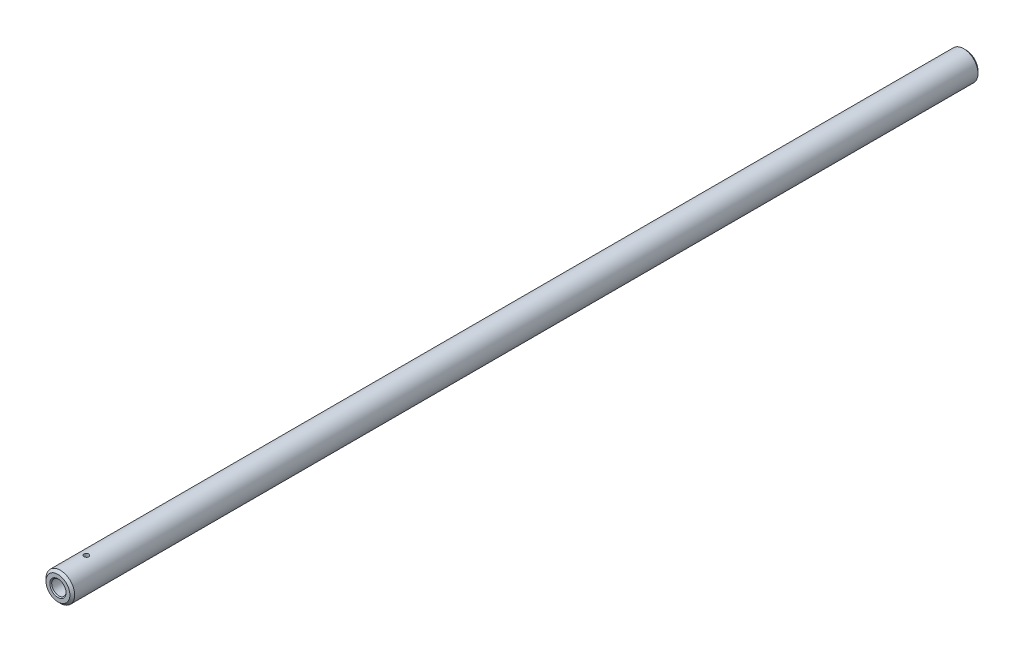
ISO-10303-21;
HEADER;
FILE_DESCRIPTION(('STEP AP214'),'2;1');
FILE_NAME('part.step','',(''),(''),'','','');
FILE_SCHEMA(('AUTOMOTIVE_DESIGN { 1 0 10303 214 1 1 1 1 }'));
ENDSEC;
DATA;
#1=APPLICATION_CONTEXT('core data for automotive mechanical design processes');
#2=APPLICATION_PROTOCOL_DEFINITION('international standard','automotive_design',2000,#1);
#3=PRODUCT_CONTEXT('',#1,'mechanical');
#4=PRODUCT('Part','Part','',(#3));
#5=PRODUCT_RELATED_PRODUCT_CATEGORY('part','',(#4));
#6=PRODUCT_DEFINITION_FORMATION('','',#4);
#7=PRODUCT_DEFINITION_CONTEXT('part definition',#1,'design');
#8=PRODUCT_DEFINITION('design','',#6,#7);
#9=PRODUCT_DEFINITION_SHAPE('','',#8);
#10=(LENGTH_UNIT() NAMED_UNIT(*) SI_UNIT(.MILLI.,.METRE.));
#11=(NAMED_UNIT(*) PLANE_ANGLE_UNIT() SI_UNIT($,.RADIAN.));
#12=(NAMED_UNIT(*) SI_UNIT($,.STERADIAN.) SOLID_ANGLE_UNIT());
#13=UNCERTAINTY_MEASURE_WITH_UNIT(LENGTH_MEASURE(1.E-05),#10,'distance_accuracy_value','');
#14=(GEOMETRIC_REPRESENTATION_CONTEXT(3) GLOBAL_UNCERTAINTY_ASSIGNED_CONTEXT((#13)) GLOBAL_UNIT_ASSIGNED_CONTEXT((#10,
#11,#12)) REPRESENTATION_CONTEXT('',''));
#15=CARTESIAN_POINT('',(0.,0.,0.));
#16=DIRECTION('',(0.,0.,1.));
#17=DIRECTION('',(1.,0.,0.));
#18=AXIS2_PLACEMENT_3D('',#15,#16,#17);
#19=CARTESIAN_POINT('',(0.,0.,190.));
#20=DIRECTION('',(0.,0.,-1.));
#21=DIRECTION('',(-1.,0.,0.));
#22=AXIS2_PLACEMENT_3D('',#19,#20,#21);
#23=CYLINDRICAL_SURFACE('',#22,3.);
#24=CARTESIAN_POINT('',(0.,-3.,184.576605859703));
#25=CARTESIAN_POINT('',(0.0278781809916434,-2.99999952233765,184.576604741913));
#26=CARTESIAN_POINT('',(0.0557715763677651,-2.99960735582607,184.574266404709));
#27=CARTESIAN_POINT('',(0.110776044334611,-2.99808068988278,184.56497872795));
#28=CARTESIAN_POINT('',(0.137886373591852,-2.99694550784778,184.558025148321));
#29=CARTESIAN_POINT('',(0.190520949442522,-2.9940601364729,184.539722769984));
#30=CARTESIAN_POINT('',(0.216046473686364,-2.99231045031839,184.528377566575));
#31=CARTESIAN_POINT('',(0.264828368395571,-2.98838845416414,184.501623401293));
#32=CARTESIAN_POINT('',(0.288084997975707,-2.98621619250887,184.486214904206));
#33=CARTESIAN_POINT('',(0.331894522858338,-2.98166663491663,184.451614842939));
#34=CARTESIAN_POINT('',(0.352422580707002,-2.97928774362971,184.432392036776));
#35=CARTESIAN_POINT('',(0.389977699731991,-2.97460525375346,184.390776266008));
#36=CARTESIAN_POINT('',(0.407004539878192,-2.97230165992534,184.368383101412));
#37=CARTESIAN_POINT('',(0.437173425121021,-2.96801513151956,184.320891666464));
#38=CARTESIAN_POINT('',(0.450290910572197,-2.96603425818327,184.295777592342));
#39=CARTESIAN_POINT('',(0.472111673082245,-2.96263957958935,184.243663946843));
#40=CARTESIAN_POINT('',(0.480815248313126,-2.96122573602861,184.216664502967));
#41=CARTESIAN_POINT('',(0.493482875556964,-2.95914107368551,184.161809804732));
#42=CARTESIAN_POINT('',(0.49748980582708,-2.9584635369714,184.133964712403));
#43=CARTESIAN_POINT('',(0.500783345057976,-2.9579078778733,184.077989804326));
#44=CARTESIAN_POINT('',(0.500070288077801,-2.95802969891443,184.04986000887));
#45=CARTESIAN_POINT('',(0.493979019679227,-2.95905285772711,183.994420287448));
#46=CARTESIAN_POINT('',(0.488648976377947,-2.95994614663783,183.967104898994));
#47=CARTESIAN_POINT('',(0.473550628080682,-2.96239899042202,183.913761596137));
#48=CARTESIAN_POINT('',(0.463782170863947,-2.96395856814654,183.887733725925));
#49=CARTESIAN_POINT('',(0.440035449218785,-2.9675769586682,183.837560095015));
#50=CARTESIAN_POINT('',(0.426037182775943,-2.96963813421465,183.813423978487));
#51=CARTESIAN_POINT('',(0.394242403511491,-2.97402583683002,183.767824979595));
#52=CARTESIAN_POINT('',(0.376445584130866,-2.97635238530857,183.746362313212));
#53=CARTESIAN_POINT('',(0.337296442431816,-2.98104405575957,183.706440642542));
#54=CARTESIAN_POINT('',(0.315902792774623,-2.9834092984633,183.688022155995));
#55=CARTESIAN_POINT('',(0.27030704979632,-2.98788520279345,183.65503030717));
#56=CARTESIAN_POINT('',(0.246104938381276,-2.98999586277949,183.640456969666));
#57=CARTESIAN_POINT('',(0.195541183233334,-2.99372778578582,183.615565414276));
#58=CARTESIAN_POINT('',(0.169177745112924,-2.99534863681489,183.605250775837));
#59=CARTESIAN_POINT('',(0.115059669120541,-2.99791500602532,183.589207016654));
#60=CARTESIAN_POINT('',(0.0873051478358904,-2.99886058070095,183.583477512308));
#61=CARTESIAN_POINT('',(0.0315419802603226,-2.99996225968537,183.576821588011));
#62=CARTESIAN_POINT('',(0.00354014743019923,-3.00012750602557,183.575839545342));
#63=CARTESIAN_POINT('',(-0.0522279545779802,-2.99967494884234,183.578558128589));
#64=CARTESIAN_POINT('',(-0.0799942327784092,-2.99905717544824,183.58225857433));
#65=CARTESIAN_POINT('',(-0.134331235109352,-2.9971136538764,183.59419082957));
#66=CARTESIAN_POINT('',(-0.160908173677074,-2.99579220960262,183.602395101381));
#67=CARTESIAN_POINT('',(-0.212309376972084,-2.99258892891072,183.623072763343));
#68=CARTESIAN_POINT('',(-0.237133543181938,-2.99070706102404,183.63554639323));
#69=CARTESIAN_POINT('',(-0.284566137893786,-2.98656903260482,183.664536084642));
#70=CARTESIAN_POINT('',(-0.307153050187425,-2.98430971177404,183.681086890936));
#71=CARTESIAN_POINT('',(-0.349248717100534,-2.9796769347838,183.71771332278));
#72=CARTESIAN_POINT('',(-0.368757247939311,-2.97730347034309,183.737789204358));
#73=CARTESIAN_POINT('',(-0.404348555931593,-2.97268035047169,183.781145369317));
#74=CARTESIAN_POINT('',(-0.420393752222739,-2.97043223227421,183.804456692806));
#75=CARTESIAN_POINT('',(-0.448340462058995,-2.96634305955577,183.853476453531));
#76=CARTESIAN_POINT('',(-0.460242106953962,-2.96450199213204,183.879184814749));
#77=CARTESIAN_POINT('',(-0.479507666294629,-2.96144690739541,183.932163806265));
#78=CARTESIAN_POINT('',(-0.486890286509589,-2.96023030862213,183.959427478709));
#79=CARTESIAN_POINT('',(-0.496967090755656,-2.95855543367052,184.014829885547));
#80=CARTESIAN_POINT('',(-0.499661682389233,-2.95809709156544,184.042968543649));
#81=CARTESIAN_POINT('',(-0.500274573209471,-2.95799346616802,184.098946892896));
#82=CARTESIAN_POINT('',(-0.498252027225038,-2.9583381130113,184.126785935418));
#83=CARTESIAN_POINT('',(-0.489615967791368,-2.95977956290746,184.181721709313));
#84=CARTESIAN_POINT('',(-0.483002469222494,-2.96087636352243,184.208818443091));
#85=CARTESIAN_POINT('',(-0.465394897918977,-2.96369471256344,184.261477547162));
#86=CARTESIAN_POINT('',(-0.454405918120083,-2.96541553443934,184.287041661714));
#87=CARTESIAN_POINT('',(-0.428365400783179,-2.96928873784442,184.335972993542));
#88=CARTESIAN_POINT('',(-0.413313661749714,-2.9714411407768,184.359340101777));
#89=CARTESIAN_POINT('',(-0.379363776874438,-2.97596690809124,184.403512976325));
#90=CARTESIAN_POINT('',(-0.360422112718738,-2.9783425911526,184.424285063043));
#91=CARTESIAN_POINT('',(-0.319321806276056,-2.98302874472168,184.462376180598));
#92=CARTESIAN_POINT('',(-0.297162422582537,-2.98533920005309,184.479694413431));
#93=CARTESIAN_POINT('',(-0.25007383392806,-2.98965305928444,184.510495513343));
#94=CARTESIAN_POINT('',(-0.225126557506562,-2.99165423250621,184.523951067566));
#95=CARTESIAN_POINT('',(-0.173302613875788,-2.99510233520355,184.546459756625));
#96=CARTESIAN_POINT('',(-0.146427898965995,-2.99654981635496,184.555517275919));
#97=CARTESIAN_POINT('',(-0.0995406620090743,-2.99841158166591,184.567006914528));
#98=CARTESIAN_POINT('',(-0.079811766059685,-2.99900405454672,184.570600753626));
#99=CARTESIAN_POINT('',(-0.0400578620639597,-2.99979843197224,184.575400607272));
#100=CARTESIAN_POINT('',(-0.0200328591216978,-3.00000034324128,184.576606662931));
#101=CARTESIAN_POINT('',(0.,-3.,184.576605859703));
#102=B_SPLINE_CURVE_WITH_KNOTS('',3,(#24,#25,#26,#27,#28,#29,#30,#31,#32,#33,#34,#35,#36,#37,
#38,#39,#40,#41,#42,#43,#44,#45,#46,#47,#48,#49,#50,#51,#52,#53,#54,#55,#56,#57,#58,#59,#60,#61,
#62,#63,#64,#65,#66,#67,#68,#69,#70,#71,#72,#73,#74,#75,#76,#77,#78,#79,#80,#81,#82,#83,#84,#85,
#86,#87,#88,#89,#90,#91,#92,#93,#94,#95,#96,#97,#98,#99,#100,#101),.UNSPECIFIED.,.T.,.F.,(4,2,2,
2,2,2,2,2,2,2,2,2,2,2,2,2,2,2,2,2,2,2,2,2,2,2,2,2,2,2,2,2,2,2,2,2,2,2,4),(0.,0.0835613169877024,
0.167199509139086,0.250769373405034,0.334329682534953,0.418604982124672,0.502885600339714,
0.587685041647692,0.672478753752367,0.756492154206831,0.840499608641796,0.923641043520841,
1.00678533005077,1.09032911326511,1.17387964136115,1.25846553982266,1.34305198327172,
1.42770937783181,1.51235968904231,1.5960157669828,1.67966862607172,1.76281561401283,
1.84596727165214,1.92985365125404,2.01374612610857,2.09850764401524,2.18326647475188,
2.26767204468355,2.35207027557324,2.43541581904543,2.51876109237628,2.60200963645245,
2.68526231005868,2.76950276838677,2.85376266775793,2.93860446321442,3.02336150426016,
3.08340849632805,3.14345445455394),.UNSPECIFIED.);
#103=CARTESIAN_POINT('',(0.,-3.,184.576605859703));
#104=VERTEX_POINT('',#103);
#105=EDGE_CURVE('E75',#104,#104,#102,.T.);
#106=ORIENTED_EDGE('',*,*,#105,.T.);
#107=EDGE_LOOP('',(#106));
#108=FACE_BOUND('',#107,.T.);
#109=CARTESIAN_POINT('',(0.,3.,184.576605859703));
#110=CARTESIAN_POINT('',(-0.0278781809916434,2.99999952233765,184.576604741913));
#111=CARTESIAN_POINT('',(-0.0557715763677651,2.99960735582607,184.574266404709));
#112=CARTESIAN_POINT('',(-0.110776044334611,2.99808068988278,184.56497872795));
#113=CARTESIAN_POINT('',(-0.137886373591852,2.99694550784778,184.558025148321));
#114=CARTESIAN_POINT('',(-0.190520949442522,2.9940601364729,184.539722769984));
#115=CARTESIAN_POINT('',(-0.216046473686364,2.99231045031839,184.528377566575));
#116=CARTESIAN_POINT('',(-0.264828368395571,2.98838845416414,184.501623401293));
#117=CARTESIAN_POINT('',(-0.288084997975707,2.98621619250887,184.486214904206));
#118=CARTESIAN_POINT('',(-0.331894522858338,2.98166663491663,184.451614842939));
#119=CARTESIAN_POINT('',(-0.352422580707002,2.97928774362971,184.432392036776));
#120=CARTESIAN_POINT('',(-0.389977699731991,2.97460525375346,184.390776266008));
#121=CARTESIAN_POINT('',(-0.407004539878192,2.97230165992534,184.368383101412));
#122=CARTESIAN_POINT('',(-0.437173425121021,2.96801513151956,184.320891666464));
#123=CARTESIAN_POINT('',(-0.450290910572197,2.96603425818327,184.295777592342));
#124=CARTESIAN_POINT('',(-0.472111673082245,2.96263957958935,184.243663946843));
#125=CARTESIAN_POINT('',(-0.480815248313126,2.96122573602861,184.216664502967));
#126=CARTESIAN_POINT('',(-0.493482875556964,2.95914107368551,184.161809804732));
#127=CARTESIAN_POINT('',(-0.49748980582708,2.9584635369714,184.133964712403));
#128=CARTESIAN_POINT('',(-0.500783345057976,2.9579078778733,184.077989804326));
#129=CARTESIAN_POINT('',(-0.500070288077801,2.95802969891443,184.04986000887));
#130=CARTESIAN_POINT('',(-0.493979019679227,2.95905285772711,183.994420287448));
#131=CARTESIAN_POINT('',(-0.488648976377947,2.95994614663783,183.967104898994));
#132=CARTESIAN_POINT('',(-0.473550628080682,2.96239899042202,183.913761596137));
#133=CARTESIAN_POINT('',(-0.463782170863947,2.96395856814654,183.887733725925));
#134=CARTESIAN_POINT('',(-0.440035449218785,2.9675769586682,183.837560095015));
#135=CARTESIAN_POINT('',(-0.426037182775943,2.96963813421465,183.813423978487));
#136=CARTESIAN_POINT('',(-0.394242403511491,2.97402583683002,183.767824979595));
#137=CARTESIAN_POINT('',(-0.376445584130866,2.97635238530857,183.746362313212));
#138=CARTESIAN_POINT('',(-0.337296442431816,2.98104405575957,183.706440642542));
#139=CARTESIAN_POINT('',(-0.315902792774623,2.9834092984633,183.688022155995));
#140=CARTESIAN_POINT('',(-0.27030704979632,2.98788520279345,183.65503030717));
#141=CARTESIAN_POINT('',(-0.246104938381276,2.98999586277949,183.640456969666));
#142=CARTESIAN_POINT('',(-0.195541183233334,2.99372778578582,183.615565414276));
#143=CARTESIAN_POINT('',(-0.169177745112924,2.99534863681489,183.605250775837));
#144=CARTESIAN_POINT('',(-0.115059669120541,2.99791500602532,183.589207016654));
#145=CARTESIAN_POINT('',(-0.0873051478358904,2.99886058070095,183.583477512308));
#146=CARTESIAN_POINT('',(-0.0315419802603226,2.99996225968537,183.576821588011));
#147=CARTESIAN_POINT('',(-0.00354014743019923,3.00012750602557,183.575839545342));
#148=CARTESIAN_POINT('',(0.0522279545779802,2.99967494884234,183.578558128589));
#149=CARTESIAN_POINT('',(0.0799942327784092,2.99905717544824,183.58225857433));
#150=CARTESIAN_POINT('',(0.134331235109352,2.9971136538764,183.59419082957));
#151=CARTESIAN_POINT('',(0.160908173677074,2.99579220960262,183.602395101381));
#152=CARTESIAN_POINT('',(0.212309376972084,2.99258892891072,183.623072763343));
#153=CARTESIAN_POINT('',(0.237133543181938,2.99070706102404,183.63554639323));
#154=CARTESIAN_POINT('',(0.284566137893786,2.98656903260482,183.664536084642));
#155=CARTESIAN_POINT('',(0.307153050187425,2.98430971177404,183.681086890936));
#156=CARTESIAN_POINT('',(0.349248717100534,2.9796769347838,183.71771332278));
#157=CARTESIAN_POINT('',(0.368757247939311,2.97730347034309,183.737789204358));
#158=CARTESIAN_POINT('',(0.404348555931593,2.97268035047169,183.781145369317));
#159=CARTESIAN_POINT('',(0.420393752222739,2.97043223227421,183.804456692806));
#160=CARTESIAN_POINT('',(0.448340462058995,2.96634305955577,183.853476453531));
#161=CARTESIAN_POINT('',(0.460242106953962,2.96450199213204,183.879184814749));
#162=CARTESIAN_POINT('',(0.479507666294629,2.96144690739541,183.932163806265));
#163=CARTESIAN_POINT('',(0.486890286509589,2.96023030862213,183.959427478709));
#164=CARTESIAN_POINT('',(0.496967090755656,2.95855543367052,184.014829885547));
#165=CARTESIAN_POINT('',(0.499661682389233,2.95809709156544,184.042968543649));
#166=CARTESIAN_POINT('',(0.500274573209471,2.95799346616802,184.098946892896));
#167=CARTESIAN_POINT('',(0.498252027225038,2.9583381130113,184.126785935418));
#168=CARTESIAN_POINT('',(0.489615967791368,2.95977956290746,184.181721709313));
#169=CARTESIAN_POINT('',(0.483002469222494,2.96087636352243,184.208818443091));
#170=CARTESIAN_POINT('',(0.465394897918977,2.96369471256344,184.261477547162));
#171=CARTESIAN_POINT('',(0.454405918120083,2.96541553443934,184.287041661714));
#172=CARTESIAN_POINT('',(0.428365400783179,2.96928873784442,184.335972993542));
#173=CARTESIAN_POINT('',(0.413313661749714,2.9714411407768,184.359340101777));
#174=CARTESIAN_POINT('',(0.379363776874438,2.97596690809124,184.403512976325));
#175=CARTESIAN_POINT('',(0.360422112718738,2.9783425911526,184.424285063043));
#176=CARTESIAN_POINT('',(0.319321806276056,2.98302874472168,184.462376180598));
#177=CARTESIAN_POINT('',(0.297162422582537,2.98533920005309,184.479694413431));
#178=CARTESIAN_POINT('',(0.25007383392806,2.98965305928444,184.510495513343));
#179=CARTESIAN_POINT('',(0.225126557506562,2.99165423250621,184.523951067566));
#180=CARTESIAN_POINT('',(0.173302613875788,2.99510233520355,184.546459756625));
#181=CARTESIAN_POINT('',(0.146427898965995,2.99654981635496,184.555517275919));
#182=CARTESIAN_POINT('',(0.0995406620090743,2.99841158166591,184.567006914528));
#183=CARTESIAN_POINT('',(0.079811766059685,2.99900405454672,184.570600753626));
#184=CARTESIAN_POINT('',(0.0400578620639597,2.99979843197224,184.575400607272));
#185=CARTESIAN_POINT('',(0.0200328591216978,3.00000034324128,184.576606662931));
#186=CARTESIAN_POINT('',(0.,3.,184.576605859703));
#187=B_SPLINE_CURVE_WITH_KNOTS('',3,(#109,#110,#111,#112,#113,#114,#115,#116,#117,#118,#119,
#120,#121,#122,#123,#124,#125,#126,#127,#128,#129,#130,#131,#132,#133,#134,#135,#136,#137,#138,
#139,#140,#141,#142,#143,#144,#145,#146,#147,#148,#149,#150,#151,#152,#153,#154,#155,#156,#157,
#158,#159,#160,#161,#162,#163,#164,#165,#166,#167,#168,#169,#170,#171,#172,#173,#174,#175,#176,
#177,#178,#179,#180,#181,#182,#183,#184,#185,#186),.UNSPECIFIED.,.T.,.F.,(4,2,2,2,2,2,2,2,2,2,2,
2,2,2,2,2,2,2,2,2,2,2,2,2,2,2,2,2,2,2,2,2,2,2,2,2,2,2,4),(0.,0.0835613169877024,
0.167199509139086,0.250769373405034,0.334329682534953,0.418604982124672,0.502885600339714,
0.587685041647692,0.672478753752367,0.756492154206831,0.840499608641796,0.923641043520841,
1.00678533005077,1.09032911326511,1.17387964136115,1.25846553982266,1.34305198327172,
1.42770937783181,1.51235968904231,1.5960157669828,1.67966862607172,1.76281561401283,
1.84596727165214,1.92985365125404,2.01374612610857,2.09850764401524,2.18326647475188,
2.26767204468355,2.35207027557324,2.43541581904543,2.51876109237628,2.60200963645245,
2.68526231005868,2.76950276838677,2.85376266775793,2.93860446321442,3.02336150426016,
3.08340849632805,3.14345445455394),.UNSPECIFIED.);
#188=CARTESIAN_POINT('',(0.,3.,184.576605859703));
#189=VERTEX_POINT('',#188);
#190=EDGE_CURVE('E70',#189,#189,#187,.T.);
#191=ORIENTED_EDGE('',*,*,#190,.T.);
#192=EDGE_LOOP('',(#191));
#193=FACE_BOUND('',#192,.T.);
#194=CARTESIAN_POINT('',(0.,0.,0.500000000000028));
#195=DIRECTION('',(0.,0.,1.));
#196=DIRECTION('',(1.,0.,0.));
#197=AXIS2_PLACEMENT_3D('',#194,#195,#196);
#198=CIRCLE('',#197,3.);
#199=CARTESIAN_POINT('',(3.,0.,0.500000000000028));
#200=VERTEX_POINT('',#199);
#201=EDGE_CURVE('E48',#200,#200,#198,.T.);
#202=ORIENTED_EDGE('',*,*,#201,.T.);
#203=EDGE_LOOP('',(#202));
#204=FACE_BOUND('',#203,.T.);
#205=CARTESIAN_POINT('',(0.,0.,189.5));
#206=DIRECTION('',(0.,0.,1.));
#207=DIRECTION('',(1.,0.,0.));
#208=AXIS2_PLACEMENT_3D('',#205,#206,#207);
#209=CIRCLE('',#208,3.);
#210=CARTESIAN_POINT('',(3.,0.,189.5));
#211=VERTEX_POINT('',#210);
#212=EDGE_CURVE('E102',#211,#211,#209,.F.);
#213=ORIENTED_EDGE('',*,*,#212,.T.);
#214=EDGE_LOOP('',(#213));
#215=FACE_BOUND('',#214,.T.);
#216=ADVANCED_FACE('F31',(#108,#193,#204,#215),#23,.T.);
#217=CARTESIAN_POINT('',(0.,0.,190.));
#218=DIRECTION('',(0.,0.,1.));
#219=DIRECTION('',(1.,0.,0.));
#220=AXIS2_PLACEMENT_3D('',#217,#218,#219);
#221=PLANE('',#220);
#222=CARTESIAN_POINT('',(0.,0.,190.));
#223=DIRECTION('',(0.,0.,1.));
#224=DIRECTION('',(1.,0.,0.));
#225=AXIS2_PLACEMENT_3D('',#222,#223,#224);
#226=CIRCLE('',#225,2.50000000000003);
#227=CARTESIAN_POINT('',(2.50000000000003,0.,190.));
#228=VERTEX_POINT('',#227);
#229=EDGE_CURVE('E10',#228,#228,#226,.T.);
#230=ORIENTED_EDGE('',*,*,#229,.T.);
#231=EDGE_LOOP('',(#230));
#232=FACE_BOUND('',#231,.T.);
#233=CARTESIAN_POINT('',(0.,0.,190.));
#234=DIRECTION('',(0.,0.,1.));
#235=DIRECTION('',(1.,0.,0.));
#236=AXIS2_PLACEMENT_3D('',#233,#234,#235);
#237=CIRCLE('',#236,1.70000000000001);
#238=CARTESIAN_POINT('',(1.70000000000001,0.,190.));
#239=VERTEX_POINT('',#238);
#240=EDGE_CURVE('E104',#239,#239,#237,.F.);
#241=ORIENTED_EDGE('',*,*,#240,.T.);
#242=EDGE_LOOP('',(#241));
#243=FACE_BOUND('',#242,.T.);
#244=ADVANCED_FACE('F83',(#232,#243),#221,.T.);
#245=CARTESIAN_POINT('',(0.,0.,0.));
#246=DIRECTION('',(0.,0.,1.));
#247=DIRECTION('',(1.,0.,0.));
#248=AXIS2_PLACEMENT_3D('',#245,#246,#247);
#249=PLANE('',#248);
#250=CARTESIAN_POINT('',(0.,0.,0.));
#251=DIRECTION('',(0.,0.,1.));
#252=DIRECTION('',(1.,0.,0.));
#253=AXIS2_PLACEMENT_3D('',#250,#251,#252);
#254=CIRCLE('',#253,2.49999999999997);
#255=CARTESIAN_POINT('',(2.49999999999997,0.,0.));
#256=VERTEX_POINT('',#255);
#257=EDGE_CURVE('E43',#256,#256,#254,.F.);
#258=ORIENTED_EDGE('',*,*,#257,.T.);
#259=EDGE_LOOP('',(#258));
#260=FACE_BOUND('',#259,.T.);
#261=ADVANCED_FACE('F85',(#260),#249,.F.);
#262=CARTESIAN_POINT('',(0.,0.,180.));
#263=DIRECTION('',(0.,0.,1.));
#264=DIRECTION('',(1.,0.,0.));
#265=AXIS2_PLACEMENT_3D('',#262,#263,#264);
#266=CYLINDRICAL_SURFACE('',#265,1.5);
#267=CARTESIAN_POINT('',(0.,-1.5,184.576605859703));
#268=CARTESIAN_POINT('',(-0.0272816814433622,-1.50000007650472,184.576605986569));
#269=CARTESIAN_POINT('',(-0.0545625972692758,-1.49924884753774,184.574365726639));
#270=CARTESIAN_POINT('',(-0.108320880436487,-1.49632605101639,184.565491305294));
#271=CARTESIAN_POINT('',(-0.13479816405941,-1.49415433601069,184.558856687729));
#272=CARTESIAN_POINT('',(-0.186166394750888,-1.48862653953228,184.541446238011));
#273=CARTESIAN_POINT('',(-0.211059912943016,-1.48527243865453,184.530677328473));
#274=CARTESIAN_POINT('',(-0.258687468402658,-1.47772222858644,184.505335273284));
#275=CARTESIAN_POINT('',(-0.281421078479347,-1.47352595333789,184.490761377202));
#276=CARTESIAN_POINT('',(-0.324870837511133,-1.46457047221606,184.457692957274));
#277=CARTESIAN_POINT('',(-0.345501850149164,-1.45979778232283,184.439090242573));
#278=CARTESIAN_POINT('',(-0.383416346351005,-1.45030157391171,184.39872228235));
#279=CARTESIAN_POINT('',(-0.400699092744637,-1.44557806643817,184.376956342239));
#280=CARTESIAN_POINT('',(-0.431912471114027,-1.43656666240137,184.330113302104));
#281=CARTESIAN_POINT('',(-0.445732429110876,-1.43229519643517,184.304958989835));
#282=CARTESIAN_POINT('',(-0.468909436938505,-1.42487652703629,184.252517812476));
#283=CARTESIAN_POINT('',(-0.478267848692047,-1.4217289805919,184.225231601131));
#284=CARTESIAN_POINT('',(-0.491936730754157,-1.41705651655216,184.170269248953));
#285=CARTESIAN_POINT('',(-0.496406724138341,-1.41548047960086,184.14263725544));
#286=CARTESIAN_POINT('',(-0.500670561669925,-1.41397828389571,184.086973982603));
#287=CARTESIAN_POINT('',(-0.500465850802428,-1.41405161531,184.058942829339));
#288=CARTESIAN_POINT('',(-0.495509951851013,-1.41579507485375,184.004637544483));
#289=CARTESIAN_POINT('',(-0.490966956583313,-1.41739207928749,183.978341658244));
#290=CARTESIAN_POINT('',(-0.477803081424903,-1.42188328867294,183.926909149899));
#291=CARTESIAN_POINT('',(-0.469181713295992,-1.42477764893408,183.901772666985));
#292=CARTESIAN_POINT('',(-0.447969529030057,-1.43158955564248,183.852899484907));
#293=CARTESIAN_POINT('',(-0.43531702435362,-1.43552282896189,183.829191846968));
#294=CARTESIAN_POINT('',(-0.406444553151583,-1.44396279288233,183.784170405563));
#295=CARTESIAN_POINT('',(-0.390223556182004,-1.44846964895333,183.762857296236));
#296=CARTESIAN_POINT('',(-0.353674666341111,-1.45783664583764,183.722060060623));
#297=CARTESIAN_POINT('',(-0.333176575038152,-1.46270294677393,183.702729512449));
#298=CARTESIAN_POINT('',(-0.289169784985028,-1.47203469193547,183.667740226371));
#299=CARTESIAN_POINT('',(-0.265660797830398,-1.47650009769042,183.652081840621));
#300=CARTESIAN_POINT('',(-0.215973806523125,-1.48458553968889,183.624757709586));
#301=CARTESIAN_POINT('',(-0.189771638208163,-1.48819675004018,183.613133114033));
#302=CARTESIAN_POINT('',(-0.135634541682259,-1.49410283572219,183.594504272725));
#303=CARTESIAN_POINT('',(-0.107700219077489,-1.4963981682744,183.587498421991));
#304=CARTESIAN_POINT('',(-0.0521919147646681,-1.4993381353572,183.578578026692));
#305=CARTESIAN_POINT('',(-0.0246547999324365,-1.50005000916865,183.576455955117));
#306=CARTESIAN_POINT('',(0.0303875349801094,-1.49994451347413,183.576772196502));
#307=CARTESIAN_POINT('',(0.0578927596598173,-1.49912740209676,183.579209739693));
#308=CARTESIAN_POINT('',(0.111259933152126,-1.49610012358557,183.588411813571));
#309=CARTESIAN_POINT('',(0.137146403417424,-1.49393099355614,183.595048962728));
#310=CARTESIAN_POINT('',(0.187427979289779,-1.48845923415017,183.612302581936));
#311=CARTESIAN_POINT('',(0.21182289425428,-1.48515646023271,183.622919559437));
#312=CARTESIAN_POINT('',(0.259144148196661,-1.47764465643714,183.648141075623));
#313=CARTESIAN_POINT('',(0.282014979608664,-1.47341407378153,183.662843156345));
#314=CARTESIAN_POINT('',(0.3250324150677,-1.46452626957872,183.69570293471));
#315=CARTESIAN_POINT('',(0.345178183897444,-1.45986891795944,183.713861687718));
#316=CARTESIAN_POINT('',(0.383126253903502,-1.45038423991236,183.754095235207));
#317=CARTESIAN_POINT('',(0.40078048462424,-1.44555880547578,183.77631047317));
#318=CARTESIAN_POINT('',(0.432128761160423,-1.43649986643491,183.823491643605));
#319=CARTESIAN_POINT('',(0.445822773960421,-1.4322663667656,183.848457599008));
#320=CARTESIAN_POINT('',(0.468798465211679,-1.42491195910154,183.900442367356));
#321=CARTESIAN_POINT('',(0.47808906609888,-1.42178880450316,183.927456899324));
#322=CARTESIAN_POINT('',(0.491947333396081,-1.41705416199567,183.982795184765));
#323=CARTESIAN_POINT('',(0.496517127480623,-1.41544199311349,184.01111834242));
#324=CARTESIAN_POINT('',(0.50063814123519,-1.41398929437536,184.06670440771));
#325=CARTESIAN_POINT('',(0.500435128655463,-1.4140620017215,184.093947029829));
#326=CARTESIAN_POINT('',(0.495621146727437,-1.4157563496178,184.147988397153));
#327=CARTESIAN_POINT('',(0.491010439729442,-1.41737789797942,184.17478716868));
#328=CARTESIAN_POINT('',(0.47768590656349,-1.42192262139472,184.226673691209));
#329=CARTESIAN_POINT('',(0.46905167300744,-1.42482049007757,184.251784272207));
#330=CARTESIAN_POINT('',(0.44798968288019,-1.43158199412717,184.300219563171));
#331=CARTESIAN_POINT('',(0.435561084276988,-1.43544584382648,184.323543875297));
#332=CARTESIAN_POINT('',(0.406630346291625,-1.4439141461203,184.368847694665));
#333=CARTESIAN_POINT('',(0.389974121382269,-1.44854355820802,184.390724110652));
#334=CARTESIAN_POINT('',(0.353321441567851,-1.45791678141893,184.431450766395));
#335=CARTESIAN_POINT('',(0.333324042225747,-1.46266062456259,184.450300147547));
#336=CARTESIAN_POINT('',(0.28962077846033,-1.47195015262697,184.485178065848));
#337=CARTESIAN_POINT('',(0.265800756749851,-1.47648090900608,184.501068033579));
#338=CARTESIAN_POINT('',(0.215678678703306,-1.48462995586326,184.528601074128));
#339=CARTESIAN_POINT('',(0.189377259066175,-1.4882484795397,184.540245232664));
#340=CARTESIAN_POINT('',(0.136246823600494,-1.49402757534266,184.558466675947));
#341=CARTESIAN_POINT('',(0.109493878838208,-1.4962460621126,184.565247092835));
#342=CARTESIAN_POINT('',(0.0551602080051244,-1.49923203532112,184.574316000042));
#343=CARTESIAN_POINT('',(0.0275797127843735,-1.49999992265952,184.576605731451));
#344=CARTESIAN_POINT('',(0.,-1.5,184.576605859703));
#345=B_SPLINE_CURVE_WITH_KNOTS('',3,(#267,#268,#269,#270,#271,#272,#273,#274,#275,#276,#277,
#278,#279,#280,#281,#282,#283,#284,#285,#286,#287,#288,#289,#290,#291,#292,#293,#294,#295,#296,
#297,#298,#299,#300,#301,#302,#303,#304,#305,#306,#307,#308,#309,#310,#311,#312,#313,#314,#315,
#316,#317,#318,#319,#320,#321,#322,#323,#324,#325,#326,#327,#328,#329,#330,#331,#332,#333,#334,
#335,#336,#337,#338,#339,#340,#341,#342,#343,#344),.UNSPECIFIED.,.T.,.F.,(4,2,2,2,2,2,2,2,2,2,2,
2,2,2,2,2,2,2,2,2,2,2,2,2,2,2,2,2,2,2,2,2,2,2,2,2,2,2,4),(0.,0.0817435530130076,
0.16349559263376,0.245111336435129,0.326743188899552,0.410923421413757,0.49512216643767,
0.581741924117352,0.668335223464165,0.752009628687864,0.835658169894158,0.915484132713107,
0.995319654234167,1.07644085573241,1.15758551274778,1.24296652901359,1.32835572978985,
1.41459202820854,1.50079834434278,1.58326791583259,1.66572356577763,1.74579078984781,
1.82586822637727,1.90805199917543,1.9902609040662,2.0762051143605,2.16215004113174,
2.24792006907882,2.33365142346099,2.41497833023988,2.4963003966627,2.57607793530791,
2.6558731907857,2.73915033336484,2.8224510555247,2.90899830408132,2.99552340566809,
3.07818279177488,3.16081933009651),.UNSPECIFIED.);
#346=CARTESIAN_POINT('',(0.,-1.5,184.576605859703));
#347=VERTEX_POINT('',#346);
#348=EDGE_CURVE('E35',#347,#347,#345,.T.);
#349=ORIENTED_EDGE('',*,*,#348,.T.);
#350=EDGE_LOOP('',(#349));
#351=FACE_BOUND('',#350,.T.);
#352=CARTESIAN_POINT('',(0.,1.5,184.576605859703));
#353=CARTESIAN_POINT('',(0.0272816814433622,1.50000007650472,184.576605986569));
#354=CARTESIAN_POINT('',(0.0545625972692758,1.49924884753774,184.574365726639));
#355=CARTESIAN_POINT('',(0.108320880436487,1.49632605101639,184.565491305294));
#356=CARTESIAN_POINT('',(0.13479816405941,1.49415433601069,184.558856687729));
#357=CARTESIAN_POINT('',(0.186166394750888,1.48862653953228,184.541446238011));
#358=CARTESIAN_POINT('',(0.211059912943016,1.48527243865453,184.530677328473));
#359=CARTESIAN_POINT('',(0.258687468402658,1.47772222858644,184.505335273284));
#360=CARTESIAN_POINT('',(0.281421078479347,1.47352595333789,184.490761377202));
#361=CARTESIAN_POINT('',(0.324870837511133,1.46457047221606,184.457692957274));
#362=CARTESIAN_POINT('',(0.345501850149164,1.45979778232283,184.439090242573));
#363=CARTESIAN_POINT('',(0.383416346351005,1.45030157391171,184.39872228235));
#364=CARTESIAN_POINT('',(0.400699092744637,1.44557806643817,184.376956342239));
#365=CARTESIAN_POINT('',(0.431912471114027,1.43656666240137,184.330113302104));
#366=CARTESIAN_POINT('',(0.445732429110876,1.43229519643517,184.304958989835));
#367=CARTESIAN_POINT('',(0.468909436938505,1.42487652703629,184.252517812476));
#368=CARTESIAN_POINT('',(0.478267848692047,1.4217289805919,184.225231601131));
#369=CARTESIAN_POINT('',(0.491936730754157,1.41705651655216,184.170269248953));
#370=CARTESIAN_POINT('',(0.496406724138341,1.41548047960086,184.14263725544));
#371=CARTESIAN_POINT('',(0.500670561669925,1.41397828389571,184.086973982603));
#372=CARTESIAN_POINT('',(0.500465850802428,1.41405161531,184.058942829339));
#373=CARTESIAN_POINT('',(0.495509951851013,1.41579507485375,184.004637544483));
#374=CARTESIAN_POINT('',(0.490966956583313,1.41739207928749,183.978341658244));
#375=CARTESIAN_POINT('',(0.477803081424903,1.42188328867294,183.926909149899));
#376=CARTESIAN_POINT('',(0.469181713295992,1.42477764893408,183.901772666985));
#377=CARTESIAN_POINT('',(0.447969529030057,1.43158955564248,183.852899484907));
#378=CARTESIAN_POINT('',(0.43531702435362,1.43552282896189,183.829191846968));
#379=CARTESIAN_POINT('',(0.406444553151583,1.44396279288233,183.784170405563));
#380=CARTESIAN_POINT('',(0.390223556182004,1.44846964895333,183.762857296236));
#381=CARTESIAN_POINT('',(0.353674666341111,1.45783664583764,183.722060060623));
#382=CARTESIAN_POINT('',(0.333176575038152,1.46270294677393,183.702729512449));
#383=CARTESIAN_POINT('',(0.289169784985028,1.47203469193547,183.667740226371));
#384=CARTESIAN_POINT('',(0.265660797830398,1.47650009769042,183.652081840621));
#385=CARTESIAN_POINT('',(0.215973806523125,1.48458553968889,183.624757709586));
#386=CARTESIAN_POINT('',(0.189771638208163,1.48819675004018,183.613133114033));
#387=CARTESIAN_POINT('',(0.135634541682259,1.49410283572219,183.594504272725));
#388=CARTESIAN_POINT('',(0.107700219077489,1.4963981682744,183.587498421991));
#389=CARTESIAN_POINT('',(0.0521919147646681,1.4993381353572,183.578578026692));
#390=CARTESIAN_POINT('',(0.0246547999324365,1.50005000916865,183.576455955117));
#391=CARTESIAN_POINT('',(-0.0303875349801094,1.49994451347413,183.576772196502));
#392=CARTESIAN_POINT('',(-0.0578927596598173,1.49912740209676,183.579209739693));
#393=CARTESIAN_POINT('',(-0.111259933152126,1.49610012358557,183.588411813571));
#394=CARTESIAN_POINT('',(-0.137146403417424,1.49393099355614,183.595048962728));
#395=CARTESIAN_POINT('',(-0.187427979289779,1.48845923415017,183.612302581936));
#396=CARTESIAN_POINT('',(-0.21182289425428,1.48515646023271,183.622919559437));
#397=CARTESIAN_POINT('',(-0.259144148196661,1.47764465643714,183.648141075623));
#398=CARTESIAN_POINT('',(-0.282014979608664,1.47341407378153,183.662843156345));
#399=CARTESIAN_POINT('',(-0.3250324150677,1.46452626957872,183.69570293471));
#400=CARTESIAN_POINT('',(-0.345178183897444,1.45986891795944,183.713861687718));
#401=CARTESIAN_POINT('',(-0.383126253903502,1.45038423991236,183.754095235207));
#402=CARTESIAN_POINT('',(-0.40078048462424,1.44555880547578,183.77631047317));
#403=CARTESIAN_POINT('',(-0.432128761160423,1.43649986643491,183.823491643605));
#404=CARTESIAN_POINT('',(-0.445822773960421,1.4322663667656,183.848457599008));
#405=CARTESIAN_POINT('',(-0.468798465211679,1.42491195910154,183.900442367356));
#406=CARTESIAN_POINT('',(-0.47808906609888,1.42178880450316,183.927456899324));
#407=CARTESIAN_POINT('',(-0.491947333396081,1.41705416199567,183.982795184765));
#408=CARTESIAN_POINT('',(-0.496517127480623,1.41544199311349,184.01111834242));
#409=CARTESIAN_POINT('',(-0.50063814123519,1.41398929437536,184.06670440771));
#410=CARTESIAN_POINT('',(-0.500435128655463,1.4140620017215,184.093947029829));
#411=CARTESIAN_POINT('',(-0.495621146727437,1.4157563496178,184.147988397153));
#412=CARTESIAN_POINT('',(-0.491010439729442,1.41737789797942,184.17478716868));
#413=CARTESIAN_POINT('',(-0.47768590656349,1.42192262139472,184.226673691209));
#414=CARTESIAN_POINT('',(-0.46905167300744,1.42482049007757,184.251784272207));
#415=CARTESIAN_POINT('',(-0.44798968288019,1.43158199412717,184.300219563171));
#416=CARTESIAN_POINT('',(-0.435561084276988,1.43544584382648,184.323543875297));
#417=CARTESIAN_POINT('',(-0.406630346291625,1.4439141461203,184.368847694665));
#418=CARTESIAN_POINT('',(-0.389974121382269,1.44854355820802,184.390724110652));
#419=CARTESIAN_POINT('',(-0.353321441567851,1.45791678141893,184.431450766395));
#420=CARTESIAN_POINT('',(-0.333324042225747,1.46266062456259,184.450300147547));
#421=CARTESIAN_POINT('',(-0.28962077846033,1.47195015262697,184.485178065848));
#422=CARTESIAN_POINT('',(-0.265800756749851,1.47648090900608,184.501068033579));
#423=CARTESIAN_POINT('',(-0.215678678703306,1.48462995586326,184.528601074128));
#424=CARTESIAN_POINT('',(-0.189377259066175,1.4882484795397,184.540245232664));
#425=CARTESIAN_POINT('',(-0.136246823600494,1.49402757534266,184.558466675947));
#426=CARTESIAN_POINT('',(-0.109493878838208,1.4962460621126,184.565247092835));
#427=CARTESIAN_POINT('',(-0.0551602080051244,1.49923203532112,184.574316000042));
#428=CARTESIAN_POINT('',(-0.0275797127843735,1.49999992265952,184.576605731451));
#429=CARTESIAN_POINT('',(0.,1.5,184.576605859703));
#430=B_SPLINE_CURVE_WITH_KNOTS('',3,(#352,#353,#354,#355,#356,#357,#358,#359,#360,#361,#362,
#363,#364,#365,#366,#367,#368,#369,#370,#371,#372,#373,#374,#375,#376,#377,#378,#379,#380,#381,
#382,#383,#384,#385,#386,#387,#388,#389,#390,#391,#392,#393,#394,#395,#396,#397,#398,#399,#400,
#401,#402,#403,#404,#405,#406,#407,#408,#409,#410,#411,#412,#413,#414,#415,#416,#417,#418,#419,
#420,#421,#422,#423,#424,#425,#426,#427,#428,#429),.UNSPECIFIED.,.T.,.F.,(4,2,2,2,2,2,2,2,2,2,2,
2,2,2,2,2,2,2,2,2,2,2,2,2,2,2,2,2,2,2,2,2,2,2,2,2,2,2,4),(0.,0.0817435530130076,
0.16349559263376,0.245111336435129,0.326743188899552,0.410923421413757,0.49512216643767,
0.581741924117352,0.668335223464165,0.752009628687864,0.835658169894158,0.915484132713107,
0.995319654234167,1.07644085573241,1.15758551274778,1.24296652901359,1.32835572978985,
1.41459202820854,1.50079834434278,1.58326791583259,1.66572356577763,1.74579078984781,
1.82586822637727,1.90805199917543,1.9902609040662,2.0762051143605,2.16215004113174,
2.24792006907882,2.33365142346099,2.41497833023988,2.4963003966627,2.57607793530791,
2.6558731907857,2.73915033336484,2.8224510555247,2.90899830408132,2.99552340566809,
3.07818279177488,3.16081933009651),.UNSPECIFIED.);
#431=CARTESIAN_POINT('',(0.,1.5,184.576605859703));
#432=VERTEX_POINT('',#431);
#433=EDGE_CURVE('E51',#432,#432,#430,.T.);
#434=ORIENTED_EDGE('',*,*,#433,.T.);
#435=EDGE_LOOP('',(#434));
#436=FACE_BOUND('',#435,.T.);
#437=CARTESIAN_POINT('',(0.,0.,189.8));
#438=DIRECTION('',(0.,0.,1.));
#439=DIRECTION('',(1.,0.,0.));
#440=AXIS2_PLACEMENT_3D('',#437,#438,#439);
#441=CIRCLE('',#440,1.5);
#442=CARTESIAN_POINT('',(1.5,0.,189.8));
#443=VERTEX_POINT('',#442);
#444=EDGE_CURVE('E109',#443,#443,#441,.T.);
#445=ORIENTED_EDGE('',*,*,#444,.T.);
#446=EDGE_LOOP('',(#445));
#447=FACE_BOUND('',#446,.T.);
#448=CARTESIAN_POINT('',(0.,0.,180.));
#449=DIRECTION('',(0.,0.,1.));
#450=DIRECTION('',(1.,0.,0.));
#451=AXIS2_PLACEMENT_3D('',#448,#449,#450);
#452=CIRCLE('',#451,1.5);
#453=CARTESIAN_POINT('',(1.5,0.,180.));
#454=VERTEX_POINT('',#453);
#455=EDGE_CURVE('E111',#454,#454,#452,.T.);
#456=ORIENTED_EDGE('',*,*,#455,.F.);
#457=EDGE_LOOP('',(#456));
#458=FACE_BOUND('',#457,.T.);
#459=ADVANCED_FACE('F55',(#351,#436,#447,#458),#266,.F.);
#460=CARTESIAN_POINT('',(0.,0.,180.));
#461=DIRECTION('',(0.,0.,1.));
#462=DIRECTION('',(1.,0.,0.));
#463=AXIS2_PLACEMENT_3D('',#460,#461,#462);
#464=PLANE('',#463);
#465=ORIENTED_EDGE('',*,*,#455,.T.);
#466=EDGE_LOOP('',(#465));
#467=FACE_BOUND('',#466,.T.);
#468=ADVANCED_FACE('F64',(#467),#464,.T.);
#469=CARTESIAN_POINT('',(0.,0.,189.8));
#470=DIRECTION('',(0.,0.,1.));
#471=DIRECTION('',(1.,0.,0.));
#472=AXIS2_PLACEMENT_3D('',#469,#470,#471);
#473=CONICAL_SURFACE('',#472,1.5,0.785398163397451);
#474=ORIENTED_EDGE('',*,*,#240,.F.);
#475=EDGE_LOOP('',(#474));
#476=FACE_BOUND('',#475,.T.);
#477=ORIENTED_EDGE('',*,*,#444,.F.);
#478=EDGE_LOOP('',(#477));
#479=FACE_BOUND('',#478,.T.);
#480=ADVANCED_FACE('F86',(#476,#479),#473,.F.);
#481=CARTESIAN_POINT('',(0.,0.,0.500000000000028));
#482=DIRECTION('',(0.,0.,1.));
#483=DIRECTION('',(1.,0.,0.));
#484=AXIS2_PLACEMENT_3D('',#481,#482,#483);
#485=CONICAL_SURFACE('',#484,3.,0.785398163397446);
#486=ORIENTED_EDGE('',*,*,#257,.F.);
#487=EDGE_LOOP('',(#486));
#488=FACE_BOUND('',#487,.T.);
#489=ORIENTED_EDGE('',*,*,#201,.F.);
#490=EDGE_LOOP('',(#489));
#491=FACE_BOUND('',#490,.T.);
#492=ADVANCED_FACE('F89',(#488,#491),#485,.T.);
#493=CARTESIAN_POINT('',(0.,0.,190.));
#494=DIRECTION('',(0.,0.,-1.));
#495=DIRECTION('',(-1.,0.,0.));
#496=AXIS2_PLACEMENT_3D('',#493,#494,#495);
#497=CONICAL_SURFACE('',#496,2.50000000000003,0.785398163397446);
#498=ORIENTED_EDGE('',*,*,#212,.F.);
#499=EDGE_LOOP('',(#498));
#500=FACE_BOUND('',#499,.T.);
#501=ORIENTED_EDGE('',*,*,#229,.F.);
#502=EDGE_LOOP('',(#501));
#503=FACE_BOUND('',#502,.T.);
#504=ADVANCED_FACE('F33',(#500,#503),#497,.T.);
#505=CARTESIAN_POINT('',(0.,-5.,184.076605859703));
#506=DIRECTION('',(0.,1.,0.));
#507=DIRECTION('',(0.,0.,1.));
#508=AXIS2_PLACEMENT_3D('',#505,#506,#507);
#509=CYLINDRICAL_SURFACE('',#508,0.5);
#510=ORIENTED_EDGE('',*,*,#433,.F.);
#511=EDGE_LOOP('',(#510));
#512=FACE_BOUND('',#511,.T.);
#513=ORIENTED_EDGE('',*,*,#190,.F.);
#514=EDGE_LOOP('',(#513));
#515=FACE_BOUND('',#514,.T.);
#516=ADVANCED_FACE('F62',(#512,#515),#509,.F.);
#517=ORIENTED_EDGE('',*,*,#348,.F.);
#518=EDGE_LOOP('',(#517));
#519=FACE_BOUND('',#518,.T.);
#520=ORIENTED_EDGE('',*,*,#105,.F.);
#521=EDGE_LOOP('',(#520));
#522=FACE_BOUND('',#521,.T.);
#523=ADVANCED_FACE('F59',(#519,#522),#509,.F.);
#524=CLOSED_SHELL('',(#216,#244,#261,#459,#468,#480,#492,#504,#516,#523));
#525=MANIFOLD_SOLID_BREP('B2',#524);
#526=ADVANCED_BREP_SHAPE_REPRESENTATION('',(#18,#525),#14);
#527=SHAPE_DEFINITION_REPRESENTATION(#9,#526);
ENDSEC;
END-ISO-10303-21;
